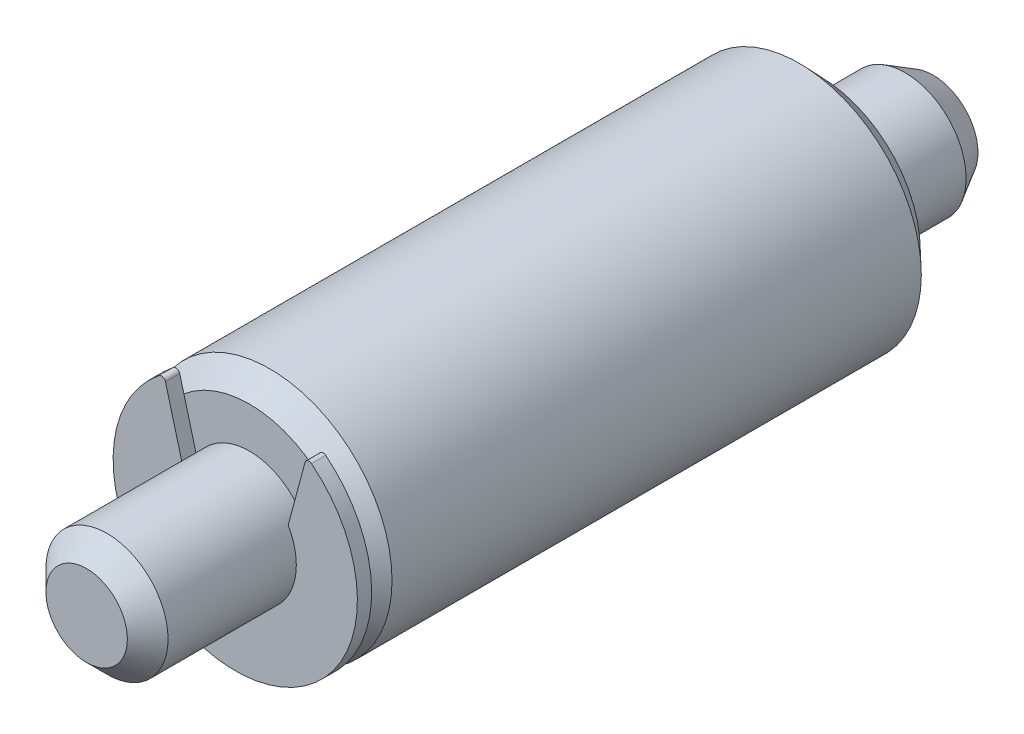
ISO-10303-21;
HEADER;
FILE_DESCRIPTION(('STEP AP214'),'2;1');
FILE_NAME('part.step','',(''),(''),'','','');
FILE_SCHEMA(('AUTOMOTIVE_DESIGN { 1 0 10303 214 1 1 1 1 }'));
ENDSEC;
DATA;
#1=APPLICATION_CONTEXT('core data for automotive mechanical design processes');
#2=APPLICATION_PROTOCOL_DEFINITION('international standard','automotive_design',2000,#1);
#3=PRODUCT_CONTEXT('',#1,'mechanical');
#4=PRODUCT('Part','Part','',(#3));
#5=PRODUCT_RELATED_PRODUCT_CATEGORY('part','',(#4));
#6=PRODUCT_DEFINITION_FORMATION('','',#4);
#7=PRODUCT_DEFINITION_CONTEXT('part definition',#1,'design');
#8=PRODUCT_DEFINITION('design','',#6,#7);
#9=PRODUCT_DEFINITION_SHAPE('','',#8);
#10=(LENGTH_UNIT() NAMED_UNIT(*) SI_UNIT(.MILLI.,.METRE.));
#11=(NAMED_UNIT(*) PLANE_ANGLE_UNIT() SI_UNIT($,.RADIAN.));
#12=(NAMED_UNIT(*) SI_UNIT($,.STERADIAN.) SOLID_ANGLE_UNIT());
#13=UNCERTAINTY_MEASURE_WITH_UNIT(LENGTH_MEASURE(1.E-05),#10,'distance_accuracy_value','');
#14=(GEOMETRIC_REPRESENTATION_CONTEXT(3) GLOBAL_UNCERTAINTY_ASSIGNED_CONTEXT((#13)) GLOBAL_UNIT_ASSIGNED_CONTEXT((#10,
#11,#12)) REPRESENTATION_CONTEXT('',''));
#15=CARTESIAN_POINT('',(0.,0.,0.));
#16=DIRECTION('',(0.,0.,1.));
#17=DIRECTION('',(1.,0.,0.));
#18=AXIS2_PLACEMENT_3D('',#15,#16,#17);
#19=CARTESIAN_POINT('',(0.,0.,36.0000000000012));
#20=DIRECTION('',(0.,0.,1.));
#21=DIRECTION('',(1.,0.,0.));
#22=AXIS2_PLACEMENT_3D('',#19,#20,#21);
#23=CYLINDRICAL_SURFACE('',#22,3.);
#24=CARTESIAN_POINT('',(0.,0.,35.0000000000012));
#25=DIRECTION('',(0.,0.,1.));
#26=DIRECTION('',(1.,0.,0.));
#27=AXIS2_PLACEMENT_3D('',#24,#25,#26);
#28=CIRCLE('',#27,3.);
#29=CARTESIAN_POINT('',(3.,0.,35.0000000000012));
#30=VERTEX_POINT('',#29);
#31=EDGE_CURVE('E22',#30,#30,#28,.T.);
#32=ORIENTED_EDGE('',*,*,#31,.F.);
#33=EDGE_LOOP('',(#32));
#34=FACE_BOUND('',#33,.T.);
#35=CARTESIAN_POINT('',(0.,0.,28.700000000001));
#36=DIRECTION('',(0.,0.,-1.));
#37=DIRECTION('',(1.,0.,0.));
#38=AXIS2_PLACEMENT_3D('',#35,#36,#37);
#39=CIRCLE('',#38,3.0000000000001);
#40=CARTESIAN_POINT('',(2.60000000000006,1.49666295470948,28.700000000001));
#41=VERTEX_POINT('',#40);
#42=CARTESIAN_POINT('',(-2.6,1.49666295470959,28.700000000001));
#43=VERTEX_POINT('',#42);
#44=EDGE_CURVE('E33',#41,#43,#39,.T.);
#45=ORIENTED_EDGE('',*,*,#44,.F.);
#46=DIRECTION('',(0.,0.,-1.));
#47=VECTOR('',#46,1.);
#48=CARTESIAN_POINT('',(2.60000000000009,1.49666295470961,28.700000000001));
#49=LINE('',#48,#47);
#50=CARTESIAN_POINT('',(2.6,1.49666295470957,28.000000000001));
#51=VERTEX_POINT('',#50);
#52=EDGE_CURVE('E220',#41,#51,#49,.T.);
#53=ORIENTED_EDGE('',*,*,#52,.T.);
#54=CARTESIAN_POINT('',(0.,0.,28.000000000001));
#55=DIRECTION('',(0.,0.,1.));
#56=DIRECTION('',(1.,0.,0.));
#57=AXIS2_PLACEMENT_3D('',#54,#55,#56);
#58=CIRCLE('',#57,3.);
#59=CARTESIAN_POINT('',(-2.60000000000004,1.49666295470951,28.000000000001));
#60=VERTEX_POINT('',#59);
#61=EDGE_CURVE('E124',#51,#60,#58,.T.);
#62=ORIENTED_EDGE('',*,*,#61,.T.);
#63=DIRECTION('',(0.,0.,-1.));
#64=VECTOR('',#63,1.);
#65=CARTESIAN_POINT('',(-2.60000000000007,1.49666295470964,28.700000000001));
#66=LINE('',#65,#64);
#67=EDGE_CURVE('E29',#43,#60,#66,.T.);
#68=ORIENTED_EDGE('',*,*,#67,.F.);
#69=EDGE_LOOP('',(#45,#53,#62,#68));
#70=FACE_BOUND('',#69,.T.);
#71=ADVANCED_FACE('F14',(#34,#70),#23,.T.);
#72=CARTESIAN_POINT('',(0.,5.00000000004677,28.000000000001));
#73=DIRECTION('',(0.,0.,1.));
#74=DIRECTION('',(1.,0.,0.));
#75=AXIS2_PLACEMENT_3D('',#72,#73,#74);
#76=PLANE('',#75);
#77=ORIENTED_EDGE('',*,*,#61,.F.);
#78=DIRECTION('',(-0.258819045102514,-0.96592582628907,0.));
#79=VECTOR('',#78,1.);
#80=CARTESIAN_POINT('',(2.60000000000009,1.49666295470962,28.000000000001));
#81=LINE('',#80,#79);
#82=CARTESIAN_POINT('',(3.22319002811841,3.82243980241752,28.000000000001));
#83=VERTEX_POINT('',#82);
#84=EDGE_CURVE('E196',#83,#51,#81,.T.);
#85=ORIENTED_EDGE('',*,*,#84,.F.);
#86=CARTESIAN_POINT('',(0.,0.,28.000000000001));
#87=DIRECTION('',(0.,0.,1.));
#88=DIRECTION('',(1.,0.,0.));
#89=AXIS2_PLACEMENT_3D('',#86,#87,#88);
#90=CIRCLE('',#89,5.00000000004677);
#91=CARTESIAN_POINT('',(-3.2231900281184,3.82243980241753,28.000000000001));
#92=VERTEX_POINT('',#91);
#93=EDGE_CURVE('E121',#83,#92,#90,.T.);
#94=ORIENTED_EDGE('',*,*,#93,.T.);
#95=DIRECTION('',(-0.25881904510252,0.965925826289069,0.));
#96=VECTOR('',#95,1.);
#97=CARTESIAN_POINT('',(-2.60000000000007,1.49666295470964,28.000000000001));
#98=LINE('',#97,#96);
#99=EDGE_CURVE('E92',#60,#92,#98,.T.);
#100=ORIENTED_EDGE('',*,*,#99,.F.);
#101=EDGE_LOOP('',(#77,#85,#94,#100));
#102=FACE_BOUND('',#101,.T.);
#103=ADVANCED_FACE('F132',(#102),#76,.T.);
#104=CARTESIAN_POINT('',(0.,0.,2.4980018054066E-13));
#105=DIRECTION('',(0.,0.,1.));
#106=DIRECTION('',(0.,1.,0.));
#107=AXIS2_PLACEMENT_3D('',#104,#105,#106);
#108=SPHERICAL_SURFACE('',#107,5.9999999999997);
#109=CARTESIAN_POINT('',(0.,0.,-5.58107460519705));
#110=DIRECTION('',(0.,0.,1.));
#111=DIRECTION('',(1.,0.,0.));
#112=AXIS2_PLACEMENT_3D('',#109,#110,#111);
#113=CIRCLE('',#112,2.20263620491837);
#114=CARTESIAN_POINT('',(2.20263620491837,0.,-5.58107460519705));
#115=VERTEX_POINT('',#114);
#116=EDGE_CURVE('E97',#115,#115,#113,.T.);
#117=ORIENTED_EDGE('',*,*,#116,.F.);
#118=EDGE_LOOP('',(#117));
#119=FACE_BOUND('',#118,.T.);
#120=ADVANCED_FACE('F16',(#119),#108,.T.);
#121=CARTESIAN_POINT('',(0.,2.,36.0000000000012));
#122=DIRECTION('',(0.,0.,1.));
#123=DIRECTION('',(1.,0.,0.));
#124=AXIS2_PLACEMENT_3D('',#121,#122,#123);
#125=PLANE('',#124);
#126=CARTESIAN_POINT('',(0.,0.,36.0000000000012));
#127=DIRECTION('',(0.,0.,1.));
#128=DIRECTION('',(1.,0.,0.));
#129=AXIS2_PLACEMENT_3D('',#126,#127,#128);
#130=CIRCLE('',#129,2.);
#131=CARTESIAN_POINT('',(2.,0.,36.0000000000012));
#132=VERTEX_POINT('',#131);
#133=EDGE_CURVE('E9',#132,#132,#130,.T.);
#134=ORIENTED_EDGE('',*,*,#133,.T.);
#135=EDGE_LOOP('',(#134));
#136=FACE_BOUND('',#135,.T.);
#137=ADVANCED_FACE('F145',(#136),#125,.T.);
#138=CARTESIAN_POINT('',(0.,0.,36.0000000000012));
#139=DIRECTION('',(0.,0.,-1.));
#140=DIRECTION('',(-1.,0.,0.));
#141=AXIS2_PLACEMENT_3D('',#138,#139,#140);
#142=CONICAL_SURFACE('',#141,2.,0.785398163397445);
#143=ORIENTED_EDGE('',*,*,#31,.T.);
#144=EDGE_LOOP('',(#143));
#145=FACE_BOUND('',#144,.T.);
#146=ORIENTED_EDGE('',*,*,#133,.F.);
#147=EDGE_LOOP('',(#146));
#148=FACE_BOUND('',#147,.T.);
#149=ADVANCED_FACE('F128',(#145,#148),#142,.T.);
#150=CARTESIAN_POINT('',(0.,0.,28.000000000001));
#151=DIRECTION('',(0.,0.,-1.));
#152=DIRECTION('',(-1.,0.,0.));
#153=AXIS2_PLACEMENT_3D('',#150,#151,#152);
#154=CONICAL_SURFACE('',#153,5.00000000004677,0.785398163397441);
#155=CARTESIAN_POINT('',(0.,0.,27.));
#156=DIRECTION('',(0.,0.,1.));
#157=DIRECTION('',(1.,0.,0.));
#158=AXIS2_PLACEMENT_3D('',#155,#156,#157);
#159=CIRCLE('',#158,6.00000000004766);
#160=CARTESIAN_POINT('',(6.00000000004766,0.,27.));
#161=VERTEX_POINT('',#160);
#162=EDGE_CURVE('E117',#161,#161,#159,.T.);
#163=ORIENTED_EDGE('',*,*,#162,.T.);
#164=EDGE_LOOP('',(#163));
#165=FACE_BOUND('',#164,.T.);
#166=ORIENTED_EDGE('',*,*,#93,.F.);
#167=EDGE_CURVE('E120',#92,#83,#90,.T.);
#168=ORIENTED_EDGE('',*,*,#167,.F.);
#169=EDGE_LOOP('',(#166,#168));
#170=FACE_BOUND('',#169,.T.);
#171=ADVANCED_FACE('F144',(#165,#170),#154,.T.);
#172=CARTESIAN_POINT('',(0.,0.,36.0000000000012));
#173=DIRECTION('',(0.,0.,1.));
#174=DIRECTION('',(1.,0.,0.));
#175=AXIS2_PLACEMENT_3D('',#172,#173,#174);
#176=CYLINDRICAL_SURFACE('',#175,6.00000000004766);
#177=CARTESIAN_POINT('',(0.,0.,1.));
#178=DIRECTION('',(0.,0.,1.));
#179=DIRECTION('',(1.,0.,0.));
#180=AXIS2_PLACEMENT_3D('',#177,#178,#179);
#181=CIRCLE('',#180,6.00000000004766);
#182=CARTESIAN_POINT('',(6.00000000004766,0.,1.));
#183=VERTEX_POINT('',#182);
#184=EDGE_CURVE('E114',#183,#183,#181,.T.);
#185=ORIENTED_EDGE('',*,*,#184,.T.);
#186=EDGE_LOOP('',(#185));
#187=FACE_BOUND('',#186,.T.);
#188=ORIENTED_EDGE('',*,*,#162,.F.);
#189=EDGE_LOOP('',(#188));
#190=FACE_BOUND('',#189,.T.);
#191=ADVANCED_FACE('F180',(#187,#190),#176,.T.);
#192=CARTESIAN_POINT('',(0.,0.,1.));
#193=DIRECTION('',(0.,0.,1.));
#194=DIRECTION('',(1.,0.,0.));
#195=AXIS2_PLACEMENT_3D('',#192,#193,#194);
#196=CONICAL_SURFACE('',#195,6.00000000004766,0.809783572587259);
#197=CARTESIAN_POINT('',(0.,0.,0.));
#198=DIRECTION('',(0.,0.,1.));
#199=DIRECTION('',(1.,0.,0.));
#200=AXIS2_PLACEMENT_3D('',#197,#198,#199);
#201=CIRCLE('',#200,4.95000000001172);
#202=CARTESIAN_POINT('',(4.95000000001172,0.,0.));
#203=VERTEX_POINT('',#202);
#204=EDGE_CURVE('E111',#203,#203,#201,.T.);
#205=ORIENTED_EDGE('',*,*,#204,.T.);
#206=EDGE_LOOP('',(#205));
#207=FACE_BOUND('',#206,.T.);
#208=ORIENTED_EDGE('',*,*,#184,.F.);
#209=EDGE_LOOP('',(#208));
#210=FACE_BOUND('',#209,.T.);
#211=ADVANCED_FACE('F174',(#207,#210),#196,.T.);
#212=CARTESIAN_POINT('',(0.,4.95000000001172,0.));
#213=DIRECTION('',(0.,0.,-1.));
#214=DIRECTION('',(-1.,0.,0.));
#215=AXIS2_PLACEMENT_3D('',#212,#213,#214);
#216=PLANE('',#215);
#217=CARTESIAN_POINT('',(0.,0.,0.));
#218=DIRECTION('',(0.,0.,1.));
#219=DIRECTION('',(1.,0.,0.));
#220=AXIS2_PLACEMENT_3D('',#217,#218,#219);
#221=CIRCLE('',#220,3.);
#222=CARTESIAN_POINT('',(3.,0.,0.));
#223=VERTEX_POINT('',#222);
#224=EDGE_CURVE('E108',#223,#223,#221,.T.);
#225=ORIENTED_EDGE('',*,*,#224,.T.);
#226=EDGE_LOOP('',(#225));
#227=FACE_BOUND('',#226,.T.);
#228=ORIENTED_EDGE('',*,*,#204,.F.);
#229=EDGE_LOOP('',(#228));
#230=FACE_BOUND('',#229,.T.);
#231=ADVANCED_FACE('F168',(#227,#230),#216,.T.);
#232=CARTESIAN_POINT('',(0.,0.,36.0000000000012));
#233=DIRECTION('',(0.,0.,1.));
#234=DIRECTION('',(1.,0.,0.));
#235=AXIS2_PLACEMENT_3D('',#232,#233,#234);
#236=CYLINDRICAL_SURFACE('',#235,3.);
#237=CARTESIAN_POINT('',(0.,0.,-4.19999999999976));
#238=DIRECTION('',(0.,0.,1.));
#239=DIRECTION('',(1.,0.,0.));
#240=AXIS2_PLACEMENT_3D('',#237,#238,#239);
#241=CIRCLE('',#240,3.);
#242=CARTESIAN_POINT('',(3.,0.,-4.19999999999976));
#243=VERTEX_POINT('',#242);
#244=EDGE_CURVE('E100',#243,#243,#241,.T.);
#245=ORIENTED_EDGE('',*,*,#244,.T.);
#246=EDGE_LOOP('',(#245));
#247=FACE_BOUND('',#246,.T.);
#248=ORIENTED_EDGE('',*,*,#224,.F.);
#249=EDGE_LOOP('',(#248));
#250=FACE_BOUND('',#249,.T.);
#251=ADVANCED_FACE('F162',(#247,#250),#236,.T.);
#252=CARTESIAN_POINT('',(0.,0.,-4.19999999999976));
#253=DIRECTION('',(0.,0.,1.));
#254=DIRECTION('',(1.,0.,0.));
#255=AXIS2_PLACEMENT_3D('',#252,#253,#254);
#256=CONICAL_SURFACE('',#255,3.,0.523598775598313);
#257=ORIENTED_EDGE('',*,*,#116,.T.);
#258=EDGE_LOOP('',(#257));
#259=FACE_BOUND('',#258,.T.);
#260=ORIENTED_EDGE('',*,*,#244,.F.);
#261=EDGE_LOOP('',(#260));
#262=FACE_BOUND('',#261,.T.);
#263=ADVANCED_FACE('F159',(#259,#262),#256,.T.);
#264=CARTESIAN_POINT('',(-3.62022249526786,4.53144448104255,28.700000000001));
#265=DIRECTION('',(0.,0.,-1.));
#266=DIRECTION('',(-1.,0.,0.));
#267=AXIS2_PLACEMENT_3D('',#264,#265,#266);
#268=CYLINDRICAL_SURFACE('',#267,0.199999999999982);
#269=CARTESIAN_POINT('',(-3.62022249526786,4.53144448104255,28.000000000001));
#270=DIRECTION('',(0.,0.,1.));
#271=DIRECTION('',(1.,0.,0.));
#272=AXIS2_PLACEMENT_3D('',#269,#270,#271);
#273=CIRCLE('',#272,0.199999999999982);
#274=CARTESIAN_POINT('',(-3.42703733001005,4.58320829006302,28.000000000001));
#275=VERTEX_POINT('',#274);
#276=CARTESIAN_POINT('',(-3.74505775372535,4.68770118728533,28.000000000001));
#277=VERTEX_POINT('',#276);
#278=EDGE_CURVE('E96',#275,#277,#273,.T.);
#279=ORIENTED_EDGE('',*,*,#278,.T.);
#280=DIRECTION('',(0.,0.,-1.));
#281=VECTOR('',#280,1.);
#282=CARTESIAN_POINT('',(-3.74505775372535,4.68770118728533,28.700000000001));
#283=LINE('',#282,#281);
#284=CARTESIAN_POINT('',(-3.74505775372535,4.68770118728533,28.700000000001));
#285=VERTEX_POINT('',#284);
#286=EDGE_CURVE('E76',#285,#277,#283,.T.);
#287=ORIENTED_EDGE('',*,*,#286,.F.);
#288=CARTESIAN_POINT('',(-3.62022249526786,4.53144448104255,28.700000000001));
#289=DIRECTION('',(0.,0.,1.));
#290=DIRECTION('',(1.,0.,0.));
#291=AXIS2_PLACEMENT_3D('',#288,#289,#290);
#292=CIRCLE('',#291,0.199999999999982);
#293=CARTESIAN_POINT('',(-3.42703733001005,4.58320829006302,28.700000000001));
#294=VERTEX_POINT('',#293);
#295=EDGE_CURVE('E83',#294,#285,#292,.T.);
#296=ORIENTED_EDGE('',*,*,#295,.F.);
#297=DIRECTION('',(0.,0.,-1.));
#298=VECTOR('',#297,1.);
#299=CARTESIAN_POINT('',(-3.42703733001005,4.58320829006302,28.700000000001));
#300=LINE('',#299,#298);
#301=EDGE_CURVE('E217',#294,#275,#300,.T.);
#302=ORIENTED_EDGE('',*,*,#301,.T.);
#303=EDGE_LOOP('',(#279,#287,#296,#302));
#304=FACE_BOUND('',#303,.T.);
#305=ADVANCED_FACE('F94',(#304),#268,.T.);
#306=CARTESIAN_POINT('',(0.,0.,28.700000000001));
#307=DIRECTION('',(0.,0.,-1.));
#308=DIRECTION('',(-1.,0.,0.));
#309=AXIS2_PLACEMENT_3D('',#306,#307,#308);
#310=CYLINDRICAL_SURFACE('',#309,6.00000000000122);
#311=CARTESIAN_POINT('',(0.,0.,28.000000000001));
#312=DIRECTION('',(0.,0.,1.));
#313=DIRECTION('',(1.,0.,0.));
#314=AXIS2_PLACEMENT_3D('',#311,#312,#313);
#315=CIRCLE('',#314,6.00000000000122);
#316=CARTESIAN_POINT('',(3.74505775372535,4.68770118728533,28.000000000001));
#317=VERTEX_POINT('',#316);
#318=EDGE_CURVE('E227',#277,#317,#315,.T.);
#319=ORIENTED_EDGE('',*,*,#318,.T.);
#320=DIRECTION('',(0.,0.,-1.));
#321=VECTOR('',#320,1.);
#322=CARTESIAN_POINT('',(3.74505775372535,4.68770118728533,28.700000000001));
#323=LINE('',#322,#321);
#324=CARTESIAN_POINT('',(3.74505775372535,4.68770118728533,28.700000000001));
#325=VERTEX_POINT('',#324);
#326=EDGE_CURVE('E79',#325,#317,#323,.T.);
#327=ORIENTED_EDGE('',*,*,#326,.F.);
#328=CARTESIAN_POINT('',(0.,0.,28.700000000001));
#329=DIRECTION('',(0.,0.,1.));
#330=DIRECTION('',(1.,0.,0.));
#331=AXIS2_PLACEMENT_3D('',#328,#329,#330);
#332=CIRCLE('',#331,6.00000000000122);
#333=EDGE_CURVE('E72',#285,#325,#332,.T.);
#334=ORIENTED_EDGE('',*,*,#333,.F.);
#335=ORIENTED_EDGE('',*,*,#286,.T.);
#336=EDGE_LOOP('',(#319,#327,#334,#335));
#337=FACE_BOUND('',#336,.T.);
#338=ADVANCED_FACE('F74',(#337),#310,.T.);
#339=CARTESIAN_POINT('',(3.62022249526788,4.53144448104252,28.700000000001));
#340=DIRECTION('',(0.,0.,-1.));
#341=DIRECTION('',(-1.,0.,0.));
#342=AXIS2_PLACEMENT_3D('',#339,#340,#341);
#343=CYLINDRICAL_SURFACE('',#342,0.19999999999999);
#344=CARTESIAN_POINT('',(3.62022249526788,4.53144448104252,28.000000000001));
#345=DIRECTION('',(0.,0.,1.));
#346=DIRECTION('',(1.,0.,0.));
#347=AXIS2_PLACEMENT_3D('',#344,#345,#346);
#348=CIRCLE('',#347,0.19999999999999);
#349=CARTESIAN_POINT('',(3.42703733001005,4.583208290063,28.000000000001));
#350=VERTEX_POINT('',#349);
#351=EDGE_CURVE('E201',#317,#350,#348,.T.);
#352=ORIENTED_EDGE('',*,*,#351,.T.);
#353=DIRECTION('',(0.,0.,-1.));
#354=VECTOR('',#353,1.);
#355=CARTESIAN_POINT('',(3.42703733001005,4.583208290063,28.700000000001));
#356=LINE('',#355,#354);
#357=CARTESIAN_POINT('',(3.42703733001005,4.583208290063,28.700000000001));
#358=VERTEX_POINT('',#357);
#359=EDGE_CURVE('E102',#358,#350,#356,.T.);
#360=ORIENTED_EDGE('',*,*,#359,.F.);
#361=CARTESIAN_POINT('',(3.62022249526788,4.53144448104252,28.700000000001));
#362=DIRECTION('',(0.,0.,1.));
#363=DIRECTION('',(1.,0.,0.));
#364=AXIS2_PLACEMENT_3D('',#361,#362,#363);
#365=CIRCLE('',#364,0.19999999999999);
#366=EDGE_CURVE('E82',#325,#358,#365,.T.);
#367=ORIENTED_EDGE('',*,*,#366,.F.);
#368=ORIENTED_EDGE('',*,*,#326,.T.);
#369=EDGE_LOOP('',(#352,#360,#367,#368));
#370=FACE_BOUND('',#369,.T.);
#371=ADVANCED_FACE('F229',(#370),#343,.T.);
#372=CARTESIAN_POINT('',(2.60000000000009,1.49666295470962,28.700000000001));
#373=DIRECTION('',(0.96592582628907,-0.258819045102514,0.));
#374=DIRECTION('',(0.258819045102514,0.96592582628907,0.));
#375=AXIS2_PLACEMENT_3D('',#372,#373,#374);
#376=PLANE('',#375);
#377=EDGE_CURVE('E200',#350,#83,#81,.T.);
#378=ORIENTED_EDGE('',*,*,#377,.T.);
#379=ORIENTED_EDGE('',*,*,#84,.T.);
#380=ORIENTED_EDGE('',*,*,#52,.F.);
#381=DIRECTION('',(-0.258819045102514,-0.96592582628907,0.));
#382=VECTOR('',#381,1.);
#383=CARTESIAN_POINT('',(2.60000000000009,1.49666295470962,28.700000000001));
#384=LINE('',#383,#382);
#385=EDGE_CURVE('E221',#358,#41,#384,.T.);
#386=ORIENTED_EDGE('',*,*,#385,.F.);
#387=ORIENTED_EDGE('',*,*,#359,.T.);
#388=EDGE_LOOP('',(#378,#379,#380,#386,#387));
#389=FACE_BOUND('',#388,.T.);
#390=ADVANCED_FACE('F210',(#389),#376,.F.);
#391=CARTESIAN_POINT('',(-2.60000000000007,1.49666295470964,28.700000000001));
#392=DIRECTION('',(-0.965925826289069,-0.25881904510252,0.));
#393=DIRECTION('',(0.25881904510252,-0.965925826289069,0.));
#394=AXIS2_PLACEMENT_3D('',#391,#392,#393);
#395=PLANE('',#394);
#396=ORIENTED_EDGE('',*,*,#99,.T.);
#397=EDGE_CURVE('E207',#92,#275,#98,.T.);
#398=ORIENTED_EDGE('',*,*,#397,.T.);
#399=ORIENTED_EDGE('',*,*,#301,.F.);
#400=DIRECTION('',(-0.25881904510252,0.965925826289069,0.));
#401=VECTOR('',#400,1.);
#402=CARTESIAN_POINT('',(-2.60000000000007,1.49666295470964,28.700000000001));
#403=LINE('',#402,#401);
#404=EDGE_CURVE('E88',#43,#294,#403,.T.);
#405=ORIENTED_EDGE('',*,*,#404,.F.);
#406=ORIENTED_EDGE('',*,*,#67,.T.);
#407=EDGE_LOOP('',(#396,#398,#399,#405,#406));
#408=FACE_BOUND('',#407,.T.);
#409=ADVANCED_FACE('F237',(#408),#395,.F.);
#410=CARTESIAN_POINT('',(-3.62022249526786,4.53144448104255,28.700000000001));
#411=DIRECTION('',(0.,0.,1.));
#412=DIRECTION('',(1.,0.,0.));
#413=AXIS2_PLACEMENT_3D('',#410,#411,#412);
#414=PLANE('',#413);
#415=ORIENTED_EDGE('',*,*,#295,.T.);
#416=ORIENTED_EDGE('',*,*,#333,.T.);
#417=ORIENTED_EDGE('',*,*,#366,.T.);
#418=ORIENTED_EDGE('',*,*,#385,.T.);
#419=ORIENTED_EDGE('',*,*,#44,.T.);
#420=ORIENTED_EDGE('',*,*,#404,.T.);
#421=EDGE_LOOP('',(#415,#416,#417,#418,#419,#420));
#422=FACE_BOUND('',#421,.T.);
#423=ADVANCED_FACE('F86',(#422),#414,.T.);
#424=CARTESIAN_POINT('',(-3.62022249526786,4.53144448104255,28.000000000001));
#425=DIRECTION('',(0.,0.,1.));
#426=DIRECTION('',(1.,0.,0.));
#427=AXIS2_PLACEMENT_3D('',#424,#425,#426);
#428=PLANE('',#427);
#429=ORIENTED_EDGE('',*,*,#167,.T.);
#430=ORIENTED_EDGE('',*,*,#377,.F.);
#431=ORIENTED_EDGE('',*,*,#351,.F.);
#432=ORIENTED_EDGE('',*,*,#318,.F.);
#433=ORIENTED_EDGE('',*,*,#278,.F.);
#434=ORIENTED_EDGE('',*,*,#397,.F.);
#435=EDGE_LOOP('',(#429,#430,#431,#432,#433,#434));
#436=FACE_BOUND('',#435,.T.);
#437=ADVANCED_FACE('F205',(#436),#428,.F.);
#438=CLOSED_SHELL('',(#71,#103,#120,#137,#149,#171,#191,#211,#231,#251,#263,#305,#338,#371,#390,
#409,#423,#437));
#439=MANIFOLD_SOLID_BREP('B1',#438);
#440=ADVANCED_BREP_SHAPE_REPRESENTATION('',(#18,#439),#14);
#441=SHAPE_DEFINITION_REPRESENTATION(#9,#440);
ENDSEC;
END-ISO-10303-21;
